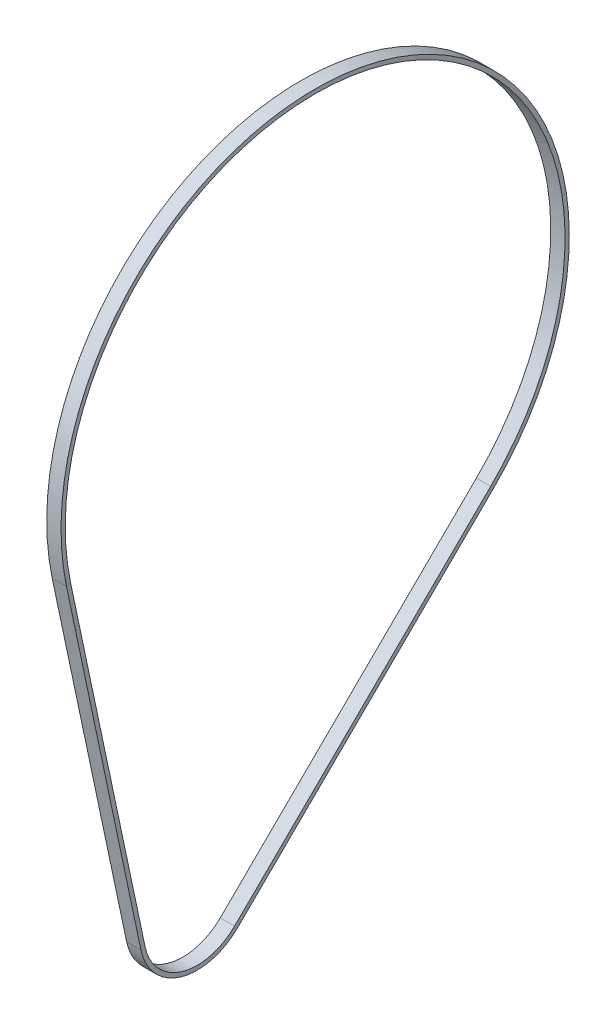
ISO-10303-21;
HEADER;
FILE_DESCRIPTION(('STEP AP214'),'2;1');
FILE_NAME('part.step','',(''),(''),'','','');
FILE_SCHEMA(('AUTOMOTIVE_DESIGN { 1 0 10303 214 1 1 1 1 }'));
ENDSEC;
DATA;
#1=APPLICATION_CONTEXT('core data for automotive mechanical design processes');
#2=APPLICATION_PROTOCOL_DEFINITION('international standard','automotive_design',2000,#1);
#3=PRODUCT_CONTEXT('',#1,'mechanical');
#4=PRODUCT('Part','Part','',(#3));
#5=PRODUCT_RELATED_PRODUCT_CATEGORY('part','',(#4));
#6=PRODUCT_DEFINITION_FORMATION('','',#4);
#7=PRODUCT_DEFINITION_CONTEXT('part definition',#1,'design');
#8=PRODUCT_DEFINITION('design','',#6,#7);
#9=PRODUCT_DEFINITION_SHAPE('','',#8);
#10=(LENGTH_UNIT() NAMED_UNIT(*) SI_UNIT(.MILLI.,.METRE.));
#11=(NAMED_UNIT(*) PLANE_ANGLE_UNIT() SI_UNIT($,.RADIAN.));
#12=(NAMED_UNIT(*) SI_UNIT($,.STERADIAN.) SOLID_ANGLE_UNIT());
#13=UNCERTAINTY_MEASURE_WITH_UNIT(LENGTH_MEASURE(1.E-05),#10,'distance_accuracy_value','');
#14=(GEOMETRIC_REPRESENTATION_CONTEXT(3) GLOBAL_UNCERTAINTY_ASSIGNED_CONTEXT((#13)) GLOBAL_UNIT_ASSIGNED_CONTEXT((#10,
#11,#12)) REPRESENTATION_CONTEXT('',''));
#15=CARTESIAN_POINT('',(0.,0.,0.));
#16=DIRECTION('',(0.,0.,1.));
#17=DIRECTION('',(1.,0.,0.));
#18=AXIS2_PLACEMENT_3D('',#15,#16,#17);
#19=CARTESIAN_POINT('',(-0.198528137,6.541818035,11.454891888));
#20=DIRECTION('',(0.,0.711714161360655,0.702469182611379));
#21=DIRECTION('',(0.,-0.702469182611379,0.711714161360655));
#22=AXIS2_PLACEMENT_3D('',#19,#20,#21);
#23=PLANE('',#22);
#24=DIRECTION('',(0.,0.702469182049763,-0.711714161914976));
#25=VECTOR('',#24,1.);
#26=CARTESIAN_POINT('',(1.498528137,-23.4473935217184,41.8387821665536));
#27=LINE('',#26,#25);
#28=CARTESIAN_POINT('',(1.498528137,-23.4473935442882,41.8387821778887));
#29=VERTEX_POINT('',#28);
#30=CARTESIAN_POINT('',(1.498528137,6.54181802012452,11.4548918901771));
#31=VERTEX_POINT('',#30);
#32=EDGE_CURVE('E20',#29,#31,#27,.T.);
#33=ORIENTED_EDGE('',*,*,#32,.F.);
#34=DIRECTION('',(1.,0.,0.));
#35=VECTOR('',#34,1.);
#36=CARTESIAN_POINT('',(0.65,-23.447393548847,41.8387821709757));
#37=LINE('',#36,#35);
#38=CARTESIAN_POINT('',(-0.198528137,-23.4473935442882,41.8387821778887));
#39=VERTEX_POINT('',#38);
#40=EDGE_CURVE('E95',#29,#39,#37,.F.);
#41=ORIENTED_EDGE('',*,*,#40,.T.);
#42=DIRECTION('',(0.,-0.702469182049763,0.711714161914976));
#43=VECTOR('',#42,1.);
#44=CARTESIAN_POINT('',(-0.198528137,6.54181799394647,11.4548919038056));
#45=LINE('',#44,#43);
#46=CARTESIAN_POINT('',(-0.198528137,6.54181802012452,11.4548918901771));
#47=VERTEX_POINT('',#46);
#48=EDGE_CURVE('E94',#47,#39,#45,.T.);
#49=ORIENTED_EDGE('',*,*,#48,.F.);
#50=DIRECTION('',(-1.,0.,0.));
#51=VECTOR('',#50,1.);
#52=CARTESIAN_POINT('',(0.65,6.541818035,11.454891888));
#53=LINE('',#52,#51);
#54=EDGE_CURVE('E84',#31,#47,#53,.T.);
#55=ORIENTED_EDGE('',*,*,#54,.F.);
#56=EDGE_LOOP('',(#33,#41,#49,#55));
#57=FACE_BOUND('',#56,.T.);
#58=ADVANCED_FACE('F16',(#57),#23,.F.);
#59=CARTESIAN_POINT('',(1.498528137,-18.593502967,46.629621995));
#60=DIRECTION('',(-1.,0.,0.));
#61=DIRECTION('',(0.,0.,1.));
#62=AXIS2_PLACEMENT_3D('',#59,#60,#61);
#63=CYLINDRICAL_SURFACE('',#62,6.81999999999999);
#64=CARTESIAN_POINT('',(1.498528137,-18.593502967,46.629621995));
#65=DIRECTION('',(-1.,0.,0.));
#66=DIRECTION('',(0.,0.,1.));
#67=AXIS2_PLACEMENT_3D('',#64,#65,#66);
#68=CIRCLE('',#67,6.81999999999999);
#69=CARTESIAN_POINT('',(1.498528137,-20.0041465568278,53.3021390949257));
#70=VERTEX_POINT('',#69);
#71=EDGE_CURVE('E100',#70,#29,#68,.F.);
#72=ORIENTED_EDGE('',*,*,#71,.F.);
#73=DIRECTION('',(-1.,0.,0.));
#74=VECTOR('',#73,1.);
#75=CARTESIAN_POINT('',(0.65,-20.004146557,53.302139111));
#76=LINE('',#75,#74);
#77=CARTESIAN_POINT('',(-0.198528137,-20.0041465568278,53.3021390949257));
#78=VERTEX_POINT('',#77);
#79=EDGE_CURVE('E115',#70,#78,#76,.T.);
#80=ORIENTED_EDGE('',*,*,#79,.T.);
#81=CARTESIAN_POINT('',(-0.198528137,-18.593502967,46.629621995));
#82=DIRECTION('',(-1.,0.,0.));
#83=DIRECTION('',(0.,0.,1.));
#84=AXIS2_PLACEMENT_3D('',#81,#82,#83);
#85=CIRCLE('',#84,6.81999999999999);
#86=EDGE_CURVE('E132',#39,#78,#85,.T.);
#87=ORIENTED_EDGE('',*,*,#86,.F.);
#88=ORIENTED_EDGE('',*,*,#40,.F.);
#89=EDGE_LOOP('',(#72,#80,#87,#88));
#90=FACE_BOUND('',#89,.T.);
#91=ADVANCED_FACE('F178',(#90),#63,.T.);
#92=CARTESIAN_POINT('',(-0.198528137,-20.004146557,53.302139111));
#93=DIRECTION('',(0.,0.206839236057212,-0.978374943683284));
#94=DIRECTION('',(0.,0.978374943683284,0.206839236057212));
#95=AXIS2_PLACEMENT_3D('',#92,#93,#94);
#96=PLANE('',#95);
#97=DIRECTION('',(0.,-0.978374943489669,-0.206839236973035));
#98=VECTOR('',#97,1.);
#99=CARTESIAN_POINT('',(1.498528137,21.7637970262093,62.132342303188));
#100=LINE('',#99,#98);
#101=CARTESIAN_POINT('',(1.498528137,21.7637970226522,62.1323422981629));
#102=VERTEX_POINT('',#101);
#103=EDGE_CURVE('E101',#102,#70,#100,.T.);
#104=ORIENTED_EDGE('',*,*,#103,.F.);
#105=DIRECTION('',(1.,0.,0.));
#106=VECTOR('',#105,1.);
#107=CARTESIAN_POINT('',(0.65,21.7637970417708,62.1323422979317));
#108=LINE('',#107,#106);
#109=CARTESIAN_POINT('',(-0.198528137,21.7637970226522,62.1323422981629));
#110=VERTEX_POINT('',#109);
#111=EDGE_CURVE('E87',#102,#110,#108,.F.);
#112=ORIENTED_EDGE('',*,*,#111,.T.);
#113=DIRECTION('',(0.,0.978374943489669,0.206839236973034));
#114=VECTOR('',#113,1.);
#115=CARTESIAN_POINT('',(-0.198528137,-20.0041465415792,53.3021390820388));
#116=LINE('',#115,#114);
#117=EDGE_CURVE('E129',#78,#110,#116,.T.);
#118=ORIENTED_EDGE('',*,*,#117,.F.);
#119=ORIENTED_EDGE('',*,*,#79,.F.);
#120=EDGE_LOOP('',(#104,#112,#118,#119));
#121=FACE_BOUND('',#120,.T.);
#122=ADVANCED_FACE('F176',(#121),#96,.F.);
#123=CARTESIAN_POINT('',(-0.198528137,-23.091536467,42.190016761));
#124=DIRECTION('',(0.,-0.711714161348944,-0.702469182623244));
#125=DIRECTION('',(0.,0.702469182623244,-0.711714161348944));
#126=AXIS2_PLACEMENT_3D('',#123,#124,#125);
#127=PLANE('',#126);
#128=DIRECTION('',(0.,0.702469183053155,-0.711714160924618));
#129=VECTOR('',#128,1.);
#130=CARTESIAN_POINT('',(-0.198528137,-23.0915364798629,42.1900167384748));
#131=LINE('',#130,#129);
#132=CARTESIAN_POINT('',(-0.198528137,-23.0915364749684,42.1900167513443));
#133=VERTEX_POINT('',#132);
#134=CARTESIAN_POINT('',(-0.198528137,6.89767512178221,11.8061264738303));
#135=VERTEX_POINT('',#134);
#136=EDGE_CURVE('E126',#133,#135,#131,.T.);
#137=ORIENTED_EDGE('',*,*,#136,.F.);
#138=DIRECTION('',(1.,0.,0.));
#139=VECTOR('',#138,1.);
#140=CARTESIAN_POINT('',(0.65,-23.0915364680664,42.1900167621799));
#141=LINE('',#140,#139);
#142=CARTESIAN_POINT('',(1.498528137,-23.0915364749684,42.1900167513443));
#143=VERTEX_POINT('',#142);
#144=EDGE_CURVE('E102',#143,#133,#141,.F.);
#145=ORIENTED_EDGE('',*,*,#144,.F.);
#146=DIRECTION('',(0.,-0.702469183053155,0.711714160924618));
#147=VECTOR('',#146,1.);
#148=CARTESIAN_POINT('',(1.498528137,6.89767512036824,11.8061264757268));
#149=LINE('',#148,#147);
#150=CARTESIAN_POINT('',(1.498528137,6.89767512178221,11.8061264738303));
#151=VERTEX_POINT('',#150);
#152=EDGE_CURVE('E144',#151,#143,#149,.T.);
#153=ORIENTED_EDGE('',*,*,#152,.F.);
#154=DIRECTION('',(-1.,0.,0.));
#155=VECTOR('',#154,1.);
#156=CARTESIAN_POINT('',(0.65,6.89767511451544,11.8061264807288));
#157=LINE('',#156,#155);
#158=EDGE_CURVE('E111',#135,#151,#157,.F.);
#159=ORIENTED_EDGE('',*,*,#158,.F.);
#160=EDGE_LOOP('',(#137,#145,#153,#159));
#161=FACE_BOUND('',#160,.T.);
#162=ADVANCED_FACE('F151',(#161),#127,.F.);
#163=CARTESIAN_POINT('',(-0.198528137,28.,32.634337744));
#164=DIRECTION('',(1.,0.,0.));
#165=DIRECTION('',(0.,0.,-1.));
#166=AXIS2_PLACEMENT_3D('',#163,#164,#165);
#167=CYLINDRICAL_SURFACE('',#166,29.65);
#168=CARTESIAN_POINT('',(1.498528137,28.,32.634337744));
#169=DIRECTION('',(1.,0.,0.));
#170=DIRECTION('',(0.,0.,-1.));
#171=AXIS2_PLACEMENT_3D('',#168,#169,#170);
#172=CIRCLE('',#171,29.65);
#173=CARTESIAN_POINT('',(1.498528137,21.8672166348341,61.6431548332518));
#174=VERTEX_POINT('',#173);
#175=EDGE_CURVE('E136',#174,#151,#172,.F.);
#176=ORIENTED_EDGE('',*,*,#175,.F.);
#177=DIRECTION('',(-1.,0.,0.));
#178=VECTOR('',#177,1.);
#179=CARTESIAN_POINT('',(0.65,21.867216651,61.643154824));
#180=LINE('',#179,#178);
#181=CARTESIAN_POINT('',(-0.198528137,21.8672166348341,61.6431548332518));
#182=VERTEX_POINT('',#181);
#183=EDGE_CURVE('E107',#174,#182,#180,.T.);
#184=ORIENTED_EDGE('',*,*,#183,.T.);
#185=CARTESIAN_POINT('',(-0.198528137,28.,32.634337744));
#186=DIRECTION('',(1.,0.,0.));
#187=DIRECTION('',(0.,0.,-1.));
#188=AXIS2_PLACEMENT_3D('',#185,#186,#187);
#189=CIRCLE('',#188,29.65);
#190=EDGE_CURVE('E123',#135,#182,#189,.T.);
#191=ORIENTED_EDGE('',*,*,#190,.F.);
#192=ORIENTED_EDGE('',*,*,#158,.T.);
#193=EDGE_LOOP('',(#176,#184,#191,#192));
#194=FACE_BOUND('',#193,.T.);
#195=ADVANCED_FACE('F161',(#194),#167,.F.);
#196=CARTESIAN_POINT('',(-0.198528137,21.867216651,61.643154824));
#197=DIRECTION('',(0.,-0.206839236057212,0.978374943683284));
#198=DIRECTION('',(0.,-0.978374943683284,-0.206839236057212));
#199=AXIS2_PLACEMENT_3D('',#196,#197,#198);
#200=PLANE('',#199);
#201=DIRECTION('',(0.,-0.978374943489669,-0.206839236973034));
#202=VECTOR('',#201,1.);
#203=CARTESIAN_POINT('',(-0.198528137,21.8672166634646,61.643154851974));
#204=LINE('',#203,#202);
#205=CARTESIAN_POINT('',(-0.198528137,-19.9007269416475,52.8129516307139));
#206=VERTEX_POINT('',#205);
#207=EDGE_CURVE('E120',#182,#206,#204,.T.);
#208=ORIENTED_EDGE('',*,*,#207,.F.);
#209=ORIENTED_EDGE('',*,*,#183,.F.);
#210=DIRECTION('',(0.,0.978374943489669,0.206839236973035));
#211=VECTOR('',#210,1.);
#212=CARTESIAN_POINT('',(1.498528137,-19.9007269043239,52.8129516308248));
#213=LINE('',#212,#211);
#214=CARTESIAN_POINT('',(1.498528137,-19.9007269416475,52.8129516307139));
#215=VERTEX_POINT('',#214);
#216=EDGE_CURVE('E138',#215,#174,#213,.T.);
#217=ORIENTED_EDGE('',*,*,#216,.F.);
#218=DIRECTION('',(-1.,0.,0.));
#219=VECTOR('',#218,1.);
#220=CARTESIAN_POINT('',(0.65,-19.9007269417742,52.8129516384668));
#221=LINE('',#220,#219);
#222=EDGE_CURVE('E35',#206,#215,#221,.F.);
#223=ORIENTED_EDGE('',*,*,#222,.F.);
#224=EDGE_LOOP('',(#208,#209,#217,#223));
#225=FACE_BOUND('',#224,.T.);
#226=ADVANCED_FACE('F154',(#225),#200,.F.);
#227=CARTESIAN_POINT('',(1.498528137,-18.593502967,46.629621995));
#228=DIRECTION('',(-1.,0.,0.));
#229=DIRECTION('',(0.,0.,1.));
#230=AXIS2_PLACEMENT_3D('',#227,#228,#229);
#231=CYLINDRICAL_SURFACE('',#230,6.31999999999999);
#232=ORIENTED_EDGE('',*,*,#222,.T.);
#233=CARTESIAN_POINT('',(1.498528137,-18.593502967,46.629621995));
#234=DIRECTION('',(-1.,0.,0.));
#235=DIRECTION('',(0.,0.,1.));
#236=AXIS2_PLACEMENT_3D('',#233,#234,#235);
#237=CIRCLE('',#236,6.31999999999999);
#238=EDGE_CURVE('E141',#143,#215,#237,.T.);
#239=ORIENTED_EDGE('',*,*,#238,.F.);
#240=ORIENTED_EDGE('',*,*,#144,.T.);
#241=CARTESIAN_POINT('',(-0.198528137,-18.593502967,46.629621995));
#242=DIRECTION('',(-1.,0.,0.));
#243=DIRECTION('',(0.,0.,1.));
#244=AXIS2_PLACEMENT_3D('',#241,#242,#243);
#245=CIRCLE('',#244,6.31999999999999);
#246=EDGE_CURVE('E91',#206,#133,#245,.F.);
#247=ORIENTED_EDGE('',*,*,#246,.F.);
#248=EDGE_LOOP('',(#232,#239,#240,#247));
#249=FACE_BOUND('',#248,.T.);
#250=ADVANCED_FACE('F152',(#249),#231,.F.);
#251=CARTESIAN_POINT('',(1.498528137,-25.914883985,63.146137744));
#252=DIRECTION('',(1.,0.,0.));
#253=DIRECTION('',(0.,0.,-1.));
#254=AXIS2_PLACEMENT_3D('',#251,#252,#253);
#255=PLANE('',#254);
#256=ORIENTED_EDGE('',*,*,#216,.T.);
#257=ORIENTED_EDGE('',*,*,#175,.T.);
#258=ORIENTED_EDGE('',*,*,#152,.T.);
#259=ORIENTED_EDGE('',*,*,#238,.T.);
#260=EDGE_LOOP('',(#256,#257,#258,#259));
#261=FACE_BOUND('',#260,.T.);
#262=ORIENTED_EDGE('',*,*,#103,.T.);
#263=ORIENTED_EDGE('',*,*,#71,.T.);
#264=ORIENTED_EDGE('',*,*,#32,.T.);
#265=CARTESIAN_POINT('',(1.498528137,28.,32.634337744));
#266=DIRECTION('',(1.,0.,0.));
#267=DIRECTION('',(0.,0.,-1.));
#268=AXIS2_PLACEMENT_3D('',#265,#266,#267);
#269=CIRCLE('',#268,30.15);
#270=EDGE_CURVE('E26',#31,#102,#269,.T.);
#271=ORIENTED_EDGE('',*,*,#270,.T.);
#272=EDGE_LOOP('',(#262,#263,#264,#271));
#273=FACE_BOUND('',#272,.T.);
#274=ADVANCED_FACE('F98',(#261,#273),#255,.T.);
#275=CARTESIAN_POINT('',(-0.198528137,-25.914883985,2.122537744));
#276=DIRECTION('',(-1.,0.,0.));
#277=DIRECTION('',(0.,0.,1.));
#278=AXIS2_PLACEMENT_3D('',#275,#276,#277);
#279=PLANE('',#278);
#280=ORIENTED_EDGE('',*,*,#207,.T.);
#281=ORIENTED_EDGE('',*,*,#246,.T.);
#282=ORIENTED_EDGE('',*,*,#136,.T.);
#283=ORIENTED_EDGE('',*,*,#190,.T.);
#284=EDGE_LOOP('',(#280,#281,#282,#283));
#285=FACE_BOUND('',#284,.T.);
#286=ORIENTED_EDGE('',*,*,#117,.T.);
#287=CARTESIAN_POINT('',(-0.198528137,28.,32.634337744));
#288=DIRECTION('',(1.,0.,0.));
#289=DIRECTION('',(0.,0.,-1.));
#290=AXIS2_PLACEMENT_3D('',#287,#288,#289);
#291=CIRCLE('',#290,30.15);
#292=EDGE_CURVE('E11',#110,#47,#291,.F.);
#293=ORIENTED_EDGE('',*,*,#292,.T.);
#294=ORIENTED_EDGE('',*,*,#48,.T.);
#295=ORIENTED_EDGE('',*,*,#86,.T.);
#296=EDGE_LOOP('',(#286,#293,#294,#295));
#297=FACE_BOUND('',#296,.T.);
#298=ADVANCED_FACE('F18',(#285,#297),#279,.T.);
#299=CARTESIAN_POINT('',(-0.198528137,28.,32.634337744));
#300=DIRECTION('',(1.,0.,0.));
#301=DIRECTION('',(0.,0.,-1.));
#302=AXIS2_PLACEMENT_3D('',#299,#300,#301);
#303=CYLINDRICAL_SURFACE('',#302,30.15);
#304=ORIENTED_EDGE('',*,*,#292,.F.);
#305=ORIENTED_EDGE('',*,*,#111,.F.);
#306=ORIENTED_EDGE('',*,*,#270,.F.);
#307=ORIENTED_EDGE('',*,*,#54,.T.);
#308=EDGE_LOOP('',(#304,#305,#306,#307));
#309=FACE_BOUND('',#308,.T.);
#310=ADVANCED_FACE('F83',(#309),#303,.T.);
#311=CLOSED_SHELL('',(#58,#91,#122,#162,#195,#226,#250,#274,#298,#310));
#312=MANIFOLD_SOLID_BREP('B1',#311);
#313=ADVANCED_BREP_SHAPE_REPRESENTATION('',(#18,#312),#14);
#314=SHAPE_DEFINITION_REPRESENTATION(#9,#313);
ENDSEC;
END-ISO-10303-21;
